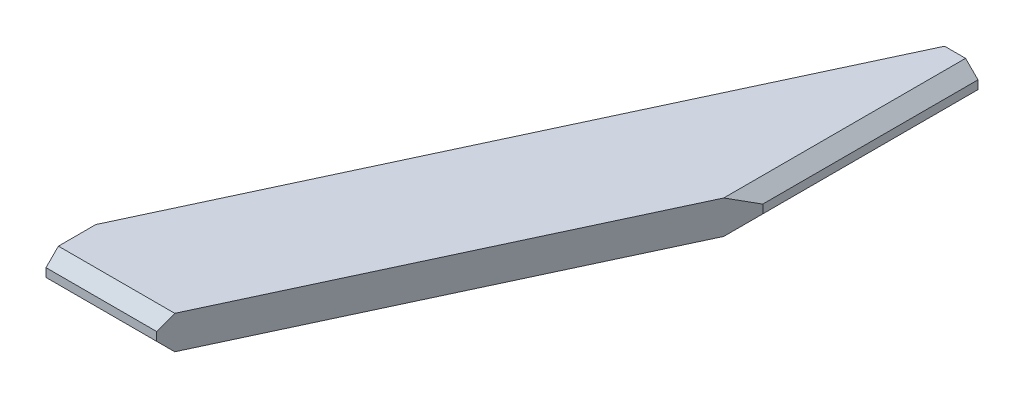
from build123d import *

# Parameters (mm, degrees)
BOSS_EXTRUDE1_DEPTH = 17.4625
CHAMFER1_SIZE       = 13


with BuildPart() as part:
    # Sketch3 → Boss-Extrude1 (new, symmetric)
    with BuildSketch(Plane(origin=(0, 0, 0), x_dir=(-1, 0, 0), z_dir=(0, 1, 0))):
        Polygon((63.262549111, 285.920774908), (179.081547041, 285.920774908), (179.081547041, 233.787816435), (-103.672048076, -372.579225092), (-138.672048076, -372.579225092), (-138.672048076, -147.12936625), align=None)
    extrude(amount=BOSS_EXTRUDE1_DEPTH, both=True)

    # Chamfer1
    chamfer1_edges = [part.edges().sort_by_distance(p)[0] for p in [
        (138.672048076, 17.4625, -259.854295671),
        (138.672048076, -17.4625, -259.854295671),
        (-121.172048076, -17.4625, 285.920774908),
        (-121.172048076, 17.4625, 285.920774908),
    ]]
    chamfer(chamfer1_edges, length=CHAMFER1_SIZE)


solid = part.part
